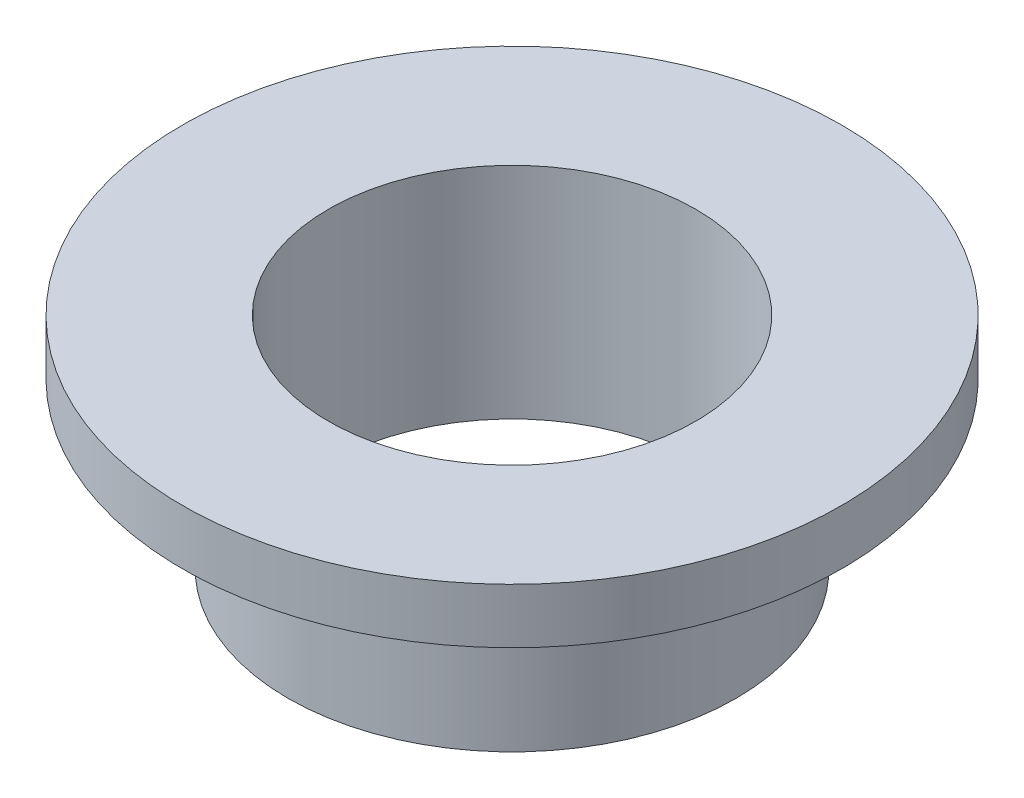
from build123d import *


with BuildPart() as part:
    # Sketch1 → Revolve1 (revolve)
    with BuildSketch(Plane.XY, mode=Mode.PRIVATE) as revolve1_sk:
        Polygon((-2.6543, 0.79375), (-4.7625, 0.79375), (-4.7625, 0), (-3.2385, 0), (-3.2385, -2.38125), (-2.6543, -2.38125), align=None)
    revolve(revolve1_sk.sketch.rotate(Axis((0, 0, 0), (0, 1, 0)), 270), axis=Axis((0, 0, 0), (0, 1, 0)))


solid = part.part
